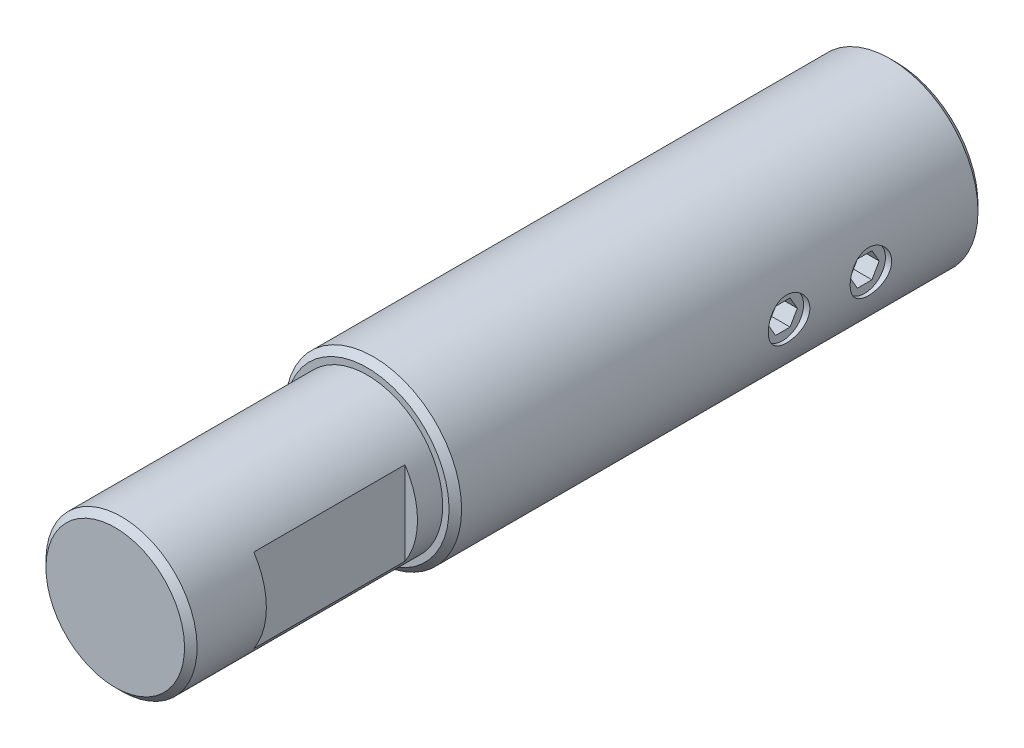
ISO-10303-21;
HEADER;
FILE_DESCRIPTION(('STEP AP214'),'2;1');
FILE_NAME('part.step','',(''),(''),'','','');
FILE_SCHEMA(('AUTOMOTIVE_DESIGN { 1 0 10303 214 1 1 1 1 }'));
ENDSEC;
DATA;
#1=APPLICATION_CONTEXT('core data for automotive mechanical design processes');
#2=APPLICATION_PROTOCOL_DEFINITION('international standard','automotive_design',2000,#1);
#3=PRODUCT_CONTEXT('',#1,'mechanical');
#4=PRODUCT('Part','Part','',(#3));
#5=PRODUCT_RELATED_PRODUCT_CATEGORY('part','',(#4));
#6=PRODUCT_DEFINITION_FORMATION('','',#4);
#7=PRODUCT_DEFINITION_CONTEXT('part definition',#1,'design');
#8=PRODUCT_DEFINITION('design','',#6,#7);
#9=PRODUCT_DEFINITION_SHAPE('','',#8);
#10=(LENGTH_UNIT() NAMED_UNIT(*) SI_UNIT(.MILLI.,.METRE.));
#11=(NAMED_UNIT(*) PLANE_ANGLE_UNIT() SI_UNIT($,.RADIAN.));
#12=(NAMED_UNIT(*) SI_UNIT($,.STERADIAN.) SOLID_ANGLE_UNIT());
#13=UNCERTAINTY_MEASURE_WITH_UNIT(LENGTH_MEASURE(1.E-05),#10,'distance_accuracy_value','');
#14=(GEOMETRIC_REPRESENTATION_CONTEXT(3) GLOBAL_UNCERTAINTY_ASSIGNED_CONTEXT((#13)) GLOBAL_UNIT_ASSIGNED_CONTEXT((#10,
#11,#12)) REPRESENTATION_CONTEXT('',''));
#15=CARTESIAN_POINT('',(0.,0.,0.));
#16=DIRECTION('',(0.,0.,1.));
#17=DIRECTION('',(1.,0.,0.));
#18=AXIS2_PLACEMENT_3D('',#15,#16,#17);
#19=CARTESIAN_POINT('',(0.,0.,0.));
#20=DIRECTION('',(0.,0.,-1.));
#21=DIRECTION('',(0.,-1.,0.));
#22=AXIS2_PLACEMENT_3D('',#19,#20,#21);
#23=CYLINDRICAL_SURFACE('',#22,6.);
#24=CARTESIAN_POINT('',(0.,0.,61.5));
#25=DIRECTION('',(0.,0.,-1.));
#26=DIRECTION('',(0.,-1.,0.));
#27=AXIS2_PLACEMENT_3D('',#24,#25,#26);
#28=CIRCLE('',#27,6.);
#29=CARTESIAN_POINT('',(0.,-6.,61.5));
#30=VERTEX_POINT('',#29);
#31=EDGE_CURVE('E435',#30,#30,#28,.T.);
#32=ORIENTED_EDGE('',*,*,#31,.T.);
#33=EDGE_LOOP('',(#32));
#34=FACE_BOUND('',#33,.T.);
#35=CARTESIAN_POINT('',(0.,0.,42.));
#36=DIRECTION('',(0.,0.,-1.));
#37=DIRECTION('',(0.,-1.,0.));
#38=AXIS2_PLACEMENT_3D('',#35,#36,#37);
#39=CIRCLE('',#38,6.);
#40=CARTESIAN_POINT('',(0.,-6.,42.));
#41=VERTEX_POINT('',#40);
#42=EDGE_CURVE('E456',#41,#41,#39,.T.);
#43=ORIENTED_EDGE('',*,*,#42,.F.);
#44=EDGE_LOOP('',(#43));
#45=FACE_BOUND('',#44,.T.);
#46=CARTESIAN_POINT('',(0.,0.,44.));
#47=DIRECTION('',(0.,0.,1.));
#48=DIRECTION('',(0.,1.,0.));
#49=AXIS2_PLACEMENT_3D('',#46,#47,#48);
#50=CIRCLE('',#49,6.);
#51=CARTESIAN_POINT('',(5.,-3.3166247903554,44.));
#52=VERTEX_POINT('',#51);
#53=CARTESIAN_POINT('',(5.,3.3166247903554,44.));
#54=VERTEX_POINT('',#53);
#55=EDGE_CURVE('E104',#52,#54,#50,.T.);
#56=ORIENTED_EDGE('',*,*,#55,.F.);
#57=DIRECTION('',(0.,0.,1.));
#58=VECTOR('',#57,1.);
#59=CARTESIAN_POINT('',(5.,-3.3166247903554,44.));
#60=LINE('',#59,#58);
#61=CARTESIAN_POINT('',(5.,-3.3166247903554,56.));
#62=VERTEX_POINT('',#61);
#63=EDGE_CURVE('E101',#52,#62,#60,.T.);
#64=ORIENTED_EDGE('',*,*,#63,.T.);
#65=CARTESIAN_POINT('',(0.,0.,56.));
#66=DIRECTION('',(0.,0.,1.));
#67=DIRECTION('',(0.,1.,0.));
#68=AXIS2_PLACEMENT_3D('',#65,#66,#67);
#69=CIRCLE('',#68,6.);
#70=CARTESIAN_POINT('',(5.,3.3166247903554,56.));
#71=VERTEX_POINT('',#70);
#72=EDGE_CURVE('E89',#62,#71,#69,.T.);
#73=ORIENTED_EDGE('',*,*,#72,.T.);
#74=DIRECTION('',(0.,0.,1.));
#75=VECTOR('',#74,1.);
#76=CARTESIAN_POINT('',(5.,3.3166247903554,44.));
#77=LINE('',#76,#75);
#78=EDGE_CURVE('E103',#54,#71,#77,.T.);
#79=ORIENTED_EDGE('',*,*,#78,.F.);
#80=EDGE_LOOP('',(#56,#64,#73,#79));
#81=FACE_BOUND('',#80,.T.);
#82=ADVANCED_FACE('F14',(#34,#45,#81),#23,.T.);
#83=CARTESIAN_POINT('',(0.,0.,0.));
#84=DIRECTION('',(0.,0.,-1.));
#85=DIRECTION('',(0.,-1.,0.));
#86=AXIS2_PLACEMENT_3D('',#83,#84,#85);
#87=CYLINDRICAL_SURFACE('',#86,7.);
#88=CARTESIAN_POINT('',(0.,0.,0.499999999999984));
#89=DIRECTION('',(0.,0.,1.));
#90=DIRECTION('',(0.,1.,0.));
#91=AXIS2_PLACEMENT_3D('',#88,#89,#90);
#92=CIRCLE('',#91,7.);
#93=CARTESIAN_POINT('',(0.,7.,0.499999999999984));
#94=VERTEX_POINT('',#93);
#95=EDGE_CURVE('E439',#94,#94,#92,.T.);
#96=ORIENTED_EDGE('',*,*,#95,.T.);
#97=EDGE_LOOP('',(#96));
#98=FACE_BOUND('',#97,.T.);
#99=CARTESIAN_POINT('',(0.,0.,41.5));
#100=DIRECTION('',(0.,0.,-1.));
#101=DIRECTION('',(0.,-1.,0.));
#102=AXIS2_PLACEMENT_3D('',#99,#100,#101);
#103=CIRCLE('',#102,7.);
#104=CARTESIAN_POINT('',(0.,-7.,41.5));
#105=VERTEX_POINT('',#104);
#106=EDGE_CURVE('E444',#105,#105,#103,.T.);
#107=ORIENTED_EDGE('',*,*,#106,.T.);
#108=EDGE_LOOP('',(#107));
#109=FACE_BOUND('',#108,.T.);
#110=CARTESIAN_POINT('',(6.80275679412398,1.65,9.));
#111=CARTESIAN_POINT('',(6.80275861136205,1.64999713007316,8.90871099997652));
#112=CARTESIAN_POINT('',(6.80461440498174,1.64239813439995,8.8173890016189));
#113=CARTESIAN_POINT('',(6.81182064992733,1.61224414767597,8.63735543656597));
#114=CARTESIAN_POINT('',(6.81717336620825,1.58967946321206,8.54864560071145));
#115=CARTESIAN_POINT('',(6.83073431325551,1.53035515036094,8.37646648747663));
#116=CARTESIAN_POINT('',(6.83893911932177,1.49361254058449,8.2929910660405));
#117=CARTESIAN_POINT('',(6.85727558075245,1.40702581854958,8.13338346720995));
#118=CARTESIAN_POINT('',(6.86740726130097,1.3571815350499,8.05725138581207));
#119=CARTESIAN_POINT('',(6.88867782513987,1.24476461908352,7.91300017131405));
#120=CARTESIAN_POINT('',(6.89983131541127,1.18198309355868,7.84504595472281));
#121=CARTESIAN_POINT('',(6.92176152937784,1.04592427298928,7.72052828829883));
#122=CARTESIAN_POINT('',(6.93253822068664,0.972646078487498,7.66396581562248));
#123=CARTESIAN_POINT('',(6.95266103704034,0.816555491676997,7.56317303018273));
#124=CARTESIAN_POINT('',(6.96198791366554,0.733636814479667,7.51910313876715));
#125=CARTESIAN_POINT('',(6.97799434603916,0.561312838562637,7.44558709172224));
#126=CARTESIAN_POINT('',(6.98467424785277,0.471908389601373,7.41613902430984));
#127=CARTESIAN_POINT('',(6.99453084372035,0.290868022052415,7.37322629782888));
#128=CARTESIAN_POINT('',(6.99776875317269,0.199301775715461,7.35948200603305));
#129=CARTESIAN_POINT('',(7.00058928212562,0.0151097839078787,7.34749086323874));
#130=CARTESIAN_POINT('',(7.00017238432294,-0.0775158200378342,7.34924196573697));
#131=CARTESIAN_POINT('',(6.99577641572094,-0.259263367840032,7.36798740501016));
#132=CARTESIAN_POINT('',(6.99186783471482,-0.348418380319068,7.38468011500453));
#133=CARTESIAN_POINT('',(6.98100889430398,-0.52262462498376,7.43235207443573));
#134=CARTESIAN_POINT('',(6.97405838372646,-0.607675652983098,7.46333203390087));
#135=CARTESIAN_POINT('',(6.95778608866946,-0.77207438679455,7.53895377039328));
#136=CARTESIAN_POINT('',(6.94844521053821,-0.851369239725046,7.58370617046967));
#137=CARTESIAN_POINT('',(6.92841069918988,-1.00143136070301,7.68551922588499));
#138=CARTESIAN_POINT('',(6.91771685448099,-1.07219729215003,7.74258180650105));
#139=CARTESIAN_POINT('',(6.89584251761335,-1.20498965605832,7.86902452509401));
#140=CARTESIAN_POINT('',(6.884656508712,-1.26676421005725,7.93866849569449));
#141=CARTESIAN_POINT('',(6.8632971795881,-1.37780936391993,8.0874443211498));
#142=CARTESIAN_POINT('',(6.85312389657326,-1.42707950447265,8.16657652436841));
#143=CARTESIAN_POINT('',(6.83492437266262,-1.51185477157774,8.33253525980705));
#144=CARTESIAN_POINT('',(6.82690665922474,-1.54730546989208,8.41939059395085));
#145=CARTESIAN_POINT('',(6.8140390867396,-1.6030277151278,8.59806127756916));
#146=CARTESIAN_POINT('',(6.80918863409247,-1.62330210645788,8.68987569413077));
#147=CARTESIAN_POINT('',(6.80332774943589,-1.64769127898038,8.87353855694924));
#148=CARTESIAN_POINT('',(6.80222947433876,-1.65217579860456,8.96533515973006));
#149=CARTESIAN_POINT('',(6.80375919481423,-1.64586488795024,9.14836457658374));
#150=CARTESIAN_POINT('',(6.80638688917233,-1.63507069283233,9.23959743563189));
#151=CARTESIAN_POINT('',(6.81498886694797,-1.59883140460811,9.41757745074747));
#152=CARTESIAN_POINT('',(6.82091521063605,-1.57359604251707,9.50436984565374));
#153=CARTESIAN_POINT('',(6.83540229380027,-1.50942069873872,9.67249368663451));
#154=CARTESIAN_POINT('',(6.84396331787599,-1.47047923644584,9.75382454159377));
#155=CARTESIAN_POINT('',(6.86294389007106,-1.37920410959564,9.91029905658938));
#156=CARTESIAN_POINT('',(6.87339357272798,-1.32664621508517,9.98530818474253));
#157=CARTESIAN_POINT('',(6.89489755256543,-1.20991829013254,10.1255780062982));
#158=CARTESIAN_POINT('',(6.90595193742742,-1.14574657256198,10.1908372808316));
#159=CARTESIAN_POINT('',(6.92771364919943,-1.00592681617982,10.3112229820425));
#160=CARTESIAN_POINT('',(6.93840801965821,-0.930057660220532,10.3660953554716));
#161=CARTESIAN_POINT('',(6.95799159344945,-0.769965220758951,10.4623180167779));
#162=CARTESIAN_POINT('',(6.96688088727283,-0.685742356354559,10.503668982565));
#163=CARTESIAN_POINT('',(6.9817988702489,-0.511894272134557,10.5713378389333));
#164=CARTESIAN_POINT('',(6.98784709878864,-0.422310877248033,10.5977586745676));
#165=CARTESIAN_POINT('',(6.99648655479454,-0.239816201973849,10.6351328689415));
#166=CARTESIAN_POINT('',(6.99907837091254,-0.146905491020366,10.6460888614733));
#167=CARTESIAN_POINT('',(7.00049202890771,0.0372082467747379,10.6520881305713));
#168=CARTESIAN_POINT('',(6.9994031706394,0.128398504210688,10.647508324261));
#169=CARTESIAN_POINT('',(6.99377268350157,0.308670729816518,10.6234197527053));
#170=CARTESIAN_POINT('',(6.98923113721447,0.397752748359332,10.6039113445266));
#171=CARTESIAN_POINT('',(6.97721604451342,0.570933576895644,10.5507117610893));
#172=CARTESIAN_POINT('',(6.96975517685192,0.655052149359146,10.5170818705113));
#173=CARTESIAN_POINT('',(6.95269208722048,0.81649879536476,10.4366509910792));
#174=CARTESIAN_POINT('',(6.94308962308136,0.893826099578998,10.3898485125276));
#175=CARTESIAN_POINT('',(6.92252474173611,1.04130725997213,10.2832139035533));
#176=CARTESIAN_POINT('',(6.91153737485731,1.11126948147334,10.2231215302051));
#177=CARTESIAN_POINT('',(6.88956325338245,1.24024523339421,10.0921276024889));
#178=CARTESIAN_POINT('',(6.8785764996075,1.29925605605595,10.0212233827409));
#179=CARTESIAN_POINT('',(6.85764827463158,1.40557849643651,9.86924540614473));
#180=CARTESIAN_POINT('',(6.84772646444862,1.45268661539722,9.7880263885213));
#181=CARTESIAN_POINT('',(6.83030721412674,1.53250931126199,9.61860266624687));
#182=CARTESIAN_POINT('',(6.82280787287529,1.56523518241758,9.53040350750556));
#183=CARTESIAN_POINT('',(6.81235745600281,1.61002842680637,9.36853084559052));
#184=CARTESIAN_POINT('',(6.80878274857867,1.62498700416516,9.29568399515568));
#185=CARTESIAN_POINT('',(6.8039817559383,1.64497362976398,9.14856531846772));
#186=CARTESIAN_POINT('',(6.80275531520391,1.65000233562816,9.07429358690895));
#187=CARTESIAN_POINT('',(6.80275679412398,1.65,9.));
#188=B_SPLINE_CURVE_WITH_KNOTS('',3,(#110,#111,#112,#113,#114,#115,#116,#117,#118,#119,#120,
#121,#122,#123,#124,#125,#126,#127,#128,#129,#130,#131,#132,#133,#134,#135,#136,#137,#138,#139,
#140,#141,#142,#143,#144,#145,#146,#147,#148,#149,#150,#151,#152,#153,#154,#155,#156,#157,#158,
#159,#160,#161,#162,#163,#164,#165,#166,#167,#168,#169,#170,#171,#172,#173,#174,#175,#176,#177,
#178,#179,#180,#181,#182,#183,#184,#185,#186,#187),.UNSPECIFIED.,.T.,.F.,(4,2,2,2,2,2,2,2,2,2,2,
2,2,2,2,2,2,2,2,2,2,2,2,2,2,2,2,2,2,2,2,2,2,2,2,2,2,2,4),(0.,0.273594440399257,
0.547366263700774,0.820810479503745,1.0942582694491,1.37252656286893,1.65081871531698,
1.9325374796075,2.21421939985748,2.49080324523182,2.76735056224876,3.03843805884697,
3.30953902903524,3.58287702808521,3.85625780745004,4.13623055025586,4.41621357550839,
4.69728844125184,4.97831061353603,5.25270687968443,5.52708096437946,5.79756789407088,
6.06808405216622,6.34337456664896,6.61870510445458,6.90008328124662,7.18144734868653,
7.46084693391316,7.74019892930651,8.01282246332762,8.28543947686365,8.55688541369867,
8.82836206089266,9.10571835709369,9.38314313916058,9.66503130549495,9.9466977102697,
10.1693714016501,10.3920303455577),.UNSPECIFIED.);
#189=CARTESIAN_POINT('',(6.80275679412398,1.65,9.));
#190=VERTEX_POINT('',#189);
#191=EDGE_CURVE('E107',#190,#190,#188,.T.);
#192=ORIENTED_EDGE('',*,*,#191,.T.);
#193=EDGE_LOOP('',(#192));
#194=FACE_BOUND('',#193,.T.);
#195=CARTESIAN_POINT('',(6.80275679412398,1.65,15.5));
#196=CARTESIAN_POINT('',(6.80275861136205,1.64999713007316,15.4087109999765));
#197=CARTESIAN_POINT('',(6.80461440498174,1.64239813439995,15.3173890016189));
#198=CARTESIAN_POINT('',(6.81182064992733,1.61224414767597,15.137355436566));
#199=CARTESIAN_POINT('',(6.81717336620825,1.58967946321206,15.0486456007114));
#200=CARTESIAN_POINT('',(6.83073431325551,1.53035515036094,14.8764664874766));
#201=CARTESIAN_POINT('',(6.83893911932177,1.49361254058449,14.7929910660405));
#202=CARTESIAN_POINT('',(6.85727558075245,1.40702581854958,14.63338346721));
#203=CARTESIAN_POINT('',(6.86740726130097,1.3571815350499,14.5572513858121));
#204=CARTESIAN_POINT('',(6.88867782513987,1.24476461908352,14.4130001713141));
#205=CARTESIAN_POINT('',(6.89983131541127,1.18198309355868,14.3450459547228));
#206=CARTESIAN_POINT('',(6.92176152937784,1.04592427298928,14.2205282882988));
#207=CARTESIAN_POINT('',(6.93253822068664,0.972646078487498,14.1639658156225));
#208=CARTESIAN_POINT('',(6.95266103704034,0.816555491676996,14.0631730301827));
#209=CARTESIAN_POINT('',(6.96198791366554,0.733636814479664,14.0191031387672));
#210=CARTESIAN_POINT('',(6.97799434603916,0.561312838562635,13.9455870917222));
#211=CARTESIAN_POINT('',(6.98467424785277,0.471908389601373,13.9161390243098));
#212=CARTESIAN_POINT('',(6.99453084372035,0.290868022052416,13.8732262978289));
#213=CARTESIAN_POINT('',(6.99776875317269,0.199301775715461,13.859482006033));
#214=CARTESIAN_POINT('',(7.00058928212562,0.0151097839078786,13.8474908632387));
#215=CARTESIAN_POINT('',(7.00017238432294,-0.077515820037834,13.849241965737));
#216=CARTESIAN_POINT('',(6.99577641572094,-0.259263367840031,13.8679874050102));
#217=CARTESIAN_POINT('',(6.99186783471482,-0.348418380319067,13.8846801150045));
#218=CARTESIAN_POINT('',(6.98100889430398,-0.522624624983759,13.9323520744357));
#219=CARTESIAN_POINT('',(6.97405838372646,-0.607675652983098,13.9633320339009));
#220=CARTESIAN_POINT('',(6.95778608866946,-0.772074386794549,14.0389537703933));
#221=CARTESIAN_POINT('',(6.94844521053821,-0.851369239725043,14.0837061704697));
#222=CARTESIAN_POINT('',(6.92841069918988,-1.001431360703,14.185519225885));
#223=CARTESIAN_POINT('',(6.91771685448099,-1.07219729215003,14.242581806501));
#224=CARTESIAN_POINT('',(6.89584251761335,-1.20498965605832,14.369024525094));
#225=CARTESIAN_POINT('',(6.88465650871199,-1.26676421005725,14.4386684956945));
#226=CARTESIAN_POINT('',(6.8632971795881,-1.37780936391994,14.5874443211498));
#227=CARTESIAN_POINT('',(6.85312389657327,-1.42707950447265,14.6665765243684));
#228=CARTESIAN_POINT('',(6.83492437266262,-1.51185477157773,14.8325352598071));
#229=CARTESIAN_POINT('',(6.82690665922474,-1.54730546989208,14.9193905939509));
#230=CARTESIAN_POINT('',(6.8140390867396,-1.6030277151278,15.0980612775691));
#231=CARTESIAN_POINT('',(6.80918863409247,-1.62330210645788,15.1898756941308));
#232=CARTESIAN_POINT('',(6.80332774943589,-1.64769127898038,15.3735385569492));
#233=CARTESIAN_POINT('',(6.80222947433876,-1.65217579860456,15.4653351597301));
#234=CARTESIAN_POINT('',(6.80375919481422,-1.64586488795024,15.6483645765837));
#235=CARTESIAN_POINT('',(6.80638688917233,-1.63507069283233,15.7395974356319));
#236=CARTESIAN_POINT('',(6.81498886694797,-1.59883140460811,15.9175774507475));
#237=CARTESIAN_POINT('',(6.82091521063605,-1.57359604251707,16.0043698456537));
#238=CARTESIAN_POINT('',(6.83540229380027,-1.50942069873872,16.1724936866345));
#239=CARTESIAN_POINT('',(6.843963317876,-1.47047923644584,16.2538245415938));
#240=CARTESIAN_POINT('',(6.86294389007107,-1.37920410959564,16.4102990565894));
#241=CARTESIAN_POINT('',(6.87339357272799,-1.32664621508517,16.4853081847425));
#242=CARTESIAN_POINT('',(6.89489755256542,-1.20991829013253,16.6255780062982));
#243=CARTESIAN_POINT('',(6.90595193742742,-1.14574657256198,16.6908372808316));
#244=CARTESIAN_POINT('',(6.92771364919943,-1.00592681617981,16.8112229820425));
#245=CARTESIAN_POINT('',(6.93840801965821,-0.930057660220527,16.8660953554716));
#246=CARTESIAN_POINT('',(6.95799159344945,-0.769965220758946,16.9623180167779));
#247=CARTESIAN_POINT('',(6.96688088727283,-0.685742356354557,17.003668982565));
#248=CARTESIAN_POINT('',(6.9817988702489,-0.511894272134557,17.0713378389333));
#249=CARTESIAN_POINT('',(6.98784709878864,-0.422310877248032,17.0977586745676));
#250=CARTESIAN_POINT('',(6.99648655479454,-0.239816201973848,17.1351328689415));
#251=CARTESIAN_POINT('',(6.99907837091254,-0.146905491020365,17.1460888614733));
#252=CARTESIAN_POINT('',(7.00049202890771,0.0372082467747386,17.1520881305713));
#253=CARTESIAN_POINT('',(6.9994031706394,0.12839850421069,17.147508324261));
#254=CARTESIAN_POINT('',(6.99377268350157,0.30867072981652,17.1234197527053));
#255=CARTESIAN_POINT('',(6.98923113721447,0.397752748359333,17.1039113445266));
#256=CARTESIAN_POINT('',(6.97721604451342,0.570933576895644,17.0507117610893));
#257=CARTESIAN_POINT('',(6.96975517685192,0.655052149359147,17.0170818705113));
#258=CARTESIAN_POINT('',(6.95269208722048,0.816498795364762,16.9366509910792));
#259=CARTESIAN_POINT('',(6.94308962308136,0.893826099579,16.8898485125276));
#260=CARTESIAN_POINT('',(6.92252474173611,1.04130725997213,16.7832139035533));
#261=CARTESIAN_POINT('',(6.91153737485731,1.11126948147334,16.7231215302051));
#262=CARTESIAN_POINT('',(6.88956325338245,1.24024523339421,16.5921276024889));
#263=CARTESIAN_POINT('',(6.87857649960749,1.29925605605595,16.5212233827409));
#264=CARTESIAN_POINT('',(6.85764827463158,1.40557849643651,16.3692454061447));
#265=CARTESIAN_POINT('',(6.84772646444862,1.45268661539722,16.2880263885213));
#266=CARTESIAN_POINT('',(6.83030721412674,1.53250931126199,16.1186026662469));
#267=CARTESIAN_POINT('',(6.82280787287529,1.56523518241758,16.0304035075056));
#268=CARTESIAN_POINT('',(6.81235745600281,1.61002842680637,15.8685308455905));
#269=CARTESIAN_POINT('',(6.80878274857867,1.62498700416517,15.7956839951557));
#270=CARTESIAN_POINT('',(6.8039817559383,1.64497362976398,15.6485653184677));
#271=CARTESIAN_POINT('',(6.80275531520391,1.65000233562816,15.574293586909));
#272=CARTESIAN_POINT('',(6.80275679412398,1.65,15.5));
#273=B_SPLINE_CURVE_WITH_KNOTS('',3,(#195,#196,#197,#198,#199,#200,#201,#202,#203,#204,#205,
#206,#207,#208,#209,#210,#211,#212,#213,#214,#215,#216,#217,#218,#219,#220,#221,#222,#223,#224,
#225,#226,#227,#228,#229,#230,#231,#232,#233,#234,#235,#236,#237,#238,#239,#240,#241,#242,#243,
#244,#245,#246,#247,#248,#249,#250,#251,#252,#253,#254,#255,#256,#257,#258,#259,#260,#261,#262,
#263,#264,#265,#266,#267,#268,#269,#270,#271,#272),.UNSPECIFIED.,.T.,.F.,(4,2,2,2,2,2,2,2,2,2,2,
2,2,2,2,2,2,2,2,2,2,2,2,2,2,2,2,2,2,2,2,2,2,2,2,2,2,2,4),(0.,0.273594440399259,
0.547366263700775,0.820810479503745,1.0942582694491,1.37252656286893,1.65081871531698,
1.9325374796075,2.21421939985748,2.49080324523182,2.76735056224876,3.03843805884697,
3.30953902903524,3.5828770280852,3.85625780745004,4.13623055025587,4.4162135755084,
4.69728844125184,4.97831061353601,5.25270687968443,5.52708096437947,5.79756789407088,
6.06808405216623,6.34337456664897,6.61870510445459,6.90008328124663,7.18144734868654,
7.46084693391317,7.74019892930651,8.01282246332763,8.28543947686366,8.55688541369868,
8.82836206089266,9.10571835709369,9.38314313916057,9.66503130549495,9.94669771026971,
10.1693714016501,10.3920303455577),.UNSPECIFIED.);
#274=CARTESIAN_POINT('',(6.80275679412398,1.65,15.5));
#275=VERTEX_POINT('',#274);
#276=EDGE_CURVE('E110',#275,#275,#273,.T.);
#277=ORIENTED_EDGE('',*,*,#276,.T.);
#278=EDGE_LOOP('',(#277));
#279=FACE_BOUND('',#278,.T.);
#280=ADVANCED_FACE('F125',(#98,#109,#194,#279),#87,.T.);
#281=CARTESIAN_POINT('',(-6.,0.,62.));
#282=DIRECTION('',(0.,0.,-1.));
#283=DIRECTION('',(0.,-1.,0.));
#284=AXIS2_PLACEMENT_3D('',#281,#282,#283);
#285=PLANE('',#284);
#286=CARTESIAN_POINT('',(0.,0.,62.));
#287=DIRECTION('',(0.,0.,-1.));
#288=DIRECTION('',(0.,-1.,0.));
#289=AXIS2_PLACEMENT_3D('',#286,#287,#288);
#290=CIRCLE('',#289,5.5);
#291=CARTESIAN_POINT('',(0.,-5.5,62.));
#292=VERTEX_POINT('',#291);
#293=EDGE_CURVE('E431',#292,#292,#290,.F.);
#294=ORIENTED_EDGE('',*,*,#293,.T.);
#295=EDGE_LOOP('',(#294));
#296=FACE_BOUND('',#295,.T.);
#297=ADVANCED_FACE('F467',(#296),#285,.F.);
#298=CARTESIAN_POINT('',(-7.,0.,42.));
#299=DIRECTION('',(0.,0.,-1.));
#300=DIRECTION('',(0.,-1.,0.));
#301=AXIS2_PLACEMENT_3D('',#298,#299,#300);
#302=PLANE('',#301);
#303=CARTESIAN_POINT('',(0.,0.,42.));
#304=DIRECTION('',(0.,0.,-1.));
#305=DIRECTION('',(0.,-1.,0.));
#306=AXIS2_PLACEMENT_3D('',#303,#304,#305);
#307=CIRCLE('',#306,6.5);
#308=CARTESIAN_POINT('',(0.,-6.5,42.));
#309=VERTEX_POINT('',#308);
#310=EDGE_CURVE('E18',#309,#309,#307,.F.);
#311=ORIENTED_EDGE('',*,*,#310,.T.);
#312=EDGE_LOOP('',(#311));
#313=FACE_BOUND('',#312,.T.);
#314=ORIENTED_EDGE('',*,*,#42,.T.);
#315=EDGE_LOOP('',(#314));
#316=FACE_BOUND('',#315,.T.);
#317=ADVANCED_FACE('F473',(#313,#316),#302,.F.);
#318=CARTESIAN_POINT('',(-4.,0.,0.));
#319=DIRECTION('',(0.,0.,1.));
#320=DIRECTION('',(0.,1.,0.));
#321=AXIS2_PLACEMENT_3D('',#318,#319,#320);
#322=PLANE('',#321);
#323=CARTESIAN_POINT('',(0.,0.,0.));
#324=DIRECTION('',(0.,0.,1.));
#325=DIRECTION('',(0.,1.,0.));
#326=AXIS2_PLACEMENT_3D('',#323,#324,#325);
#327=CIRCLE('',#326,6.5);
#328=CARTESIAN_POINT('',(0.,6.5,0.));
#329=VERTEX_POINT('',#328);
#330=EDGE_CURVE('E447',#329,#329,#327,.F.);
#331=ORIENTED_EDGE('',*,*,#330,.T.);
#332=EDGE_LOOP('',(#331));
#333=FACE_BOUND('',#332,.T.);
#334=CARTESIAN_POINT('',(0.,0.,0.));
#335=DIRECTION('',(0.,0.,1.));
#336=DIRECTION('',(0.,1.,0.));
#337=AXIS2_PLACEMENT_3D('',#334,#335,#336);
#338=CIRCLE('',#337,4.57735026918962);
#339=CARTESIAN_POINT('',(0.,4.57735026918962,0.));
#340=VERTEX_POINT('',#339);
#341=EDGE_CURVE('E450',#340,#340,#338,.T.);
#342=ORIENTED_EDGE('',*,*,#341,.T.);
#343=EDGE_LOOP('',(#342));
#344=FACE_BOUND('',#343,.T.);
#345=ADVANCED_FACE('F143',(#333,#344),#322,.F.);
#346=CARTESIAN_POINT('',(0.,0.,0.));
#347=DIRECTION('',(0.,0.,-1.));
#348=DIRECTION('',(0.,-1.,0.));
#349=AXIS2_PLACEMENT_3D('',#346,#347,#348);
#350=CYLINDRICAL_SURFACE('',#349,4.);
#351=CARTESIAN_POINT('',(4.,0.,7.));
#352=CARTESIAN_POINT('',(3.99999426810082,-0.105143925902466,7.00000660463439));
#353=CARTESIAN_POINT('',(3.99580982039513,-0.210413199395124,7.00834014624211));
#354=CARTESIAN_POINT('',(3.97948312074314,-0.417840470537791,7.04130576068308));
#355=CARTESIAN_POINT('',(3.96732575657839,-0.519992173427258,7.06596878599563));
#356=CARTESIAN_POINT('',(3.93632558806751,-0.717867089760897,7.13038761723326));
#357=CARTESIAN_POINT('',(3.91750878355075,-0.813613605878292,7.17008476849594));
#358=CARTESIAN_POINT('',(3.87491553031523,-0.996945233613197,7.26314124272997));
#359=CARTESIAN_POINT('',(3.85113947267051,-1.08453098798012,7.31649948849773));
#360=CARTESIAN_POINT('',(3.79912516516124,-1.25501563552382,7.43903449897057));
#361=CARTESIAN_POINT('',(3.77070398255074,-1.33731042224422,7.50897295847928));
#362=CARTESIAN_POINT('',(3.71319940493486,-1.48955888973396,7.66104295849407));
#363=CARTESIAN_POINT('',(3.68411552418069,-1.55950316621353,7.74318370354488));
#364=CARTESIAN_POINT('',(3.62597902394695,-1.69050400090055,7.92496669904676));
#365=CARTESIAN_POINT('',(3.59710373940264,-1.75045067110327,8.02547219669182));
#366=CARTESIAN_POINT('',(3.54571957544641,-1.85233645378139,8.23673467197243));
#367=CARTESIAN_POINT('',(3.52320615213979,-1.89428842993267,8.34748425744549));
#368=CARTESIAN_POINT('',(3.48915734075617,-1.95626488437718,8.56933021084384));
#369=CARTESIAN_POINT('',(3.47704543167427,-1.97745171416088,8.68000890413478));
#370=CARTESIAN_POINT('',(3.46363779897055,-2.00085398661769,8.90395767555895));
#371=CARTESIAN_POINT('',(3.46233138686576,-2.00308817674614,9.01722508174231));
#372=CARTESIAN_POINT('',(3.47021860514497,-1.98937457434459,9.22857204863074));
#373=CARTESIAN_POINT('',(3.47817527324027,-1.97556911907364,9.3268480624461));
#374=CARTESIAN_POINT('',(3.50152457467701,-1.93387969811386,9.51944381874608));
#375=CARTESIAN_POINT('',(3.51691957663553,-1.9059912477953,9.61376229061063));
#376=CARTESIAN_POINT('',(3.55374952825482,-1.83641956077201,9.79845826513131));
#377=CARTESIAN_POINT('',(3.57531681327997,-1.79443013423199,9.88869279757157));
#378=CARTESIAN_POINT('',(3.62206808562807,-1.69808337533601,10.06126858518));
#379=CARTESIAN_POINT('',(3.64725369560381,-1.64372048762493,10.1436062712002));
#380=CARTESIAN_POINT('',(3.70226315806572,-1.51613210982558,10.3090425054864));
#381=CARTESIAN_POINT('',(3.73227020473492,-1.44138891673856,10.3909137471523));
#382=CARTESIAN_POINT('',(3.79095246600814,-1.27911115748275,10.5414708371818));
#383=CARTESIAN_POINT('',(3.81962703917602,-1.19157051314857,10.6101503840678));
#384=CARTESIAN_POINT('',(3.87403974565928,-1.0010330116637,10.7353713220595));
#385=CARTESIAN_POINT('',(3.89957968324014,-0.897507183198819,10.7912009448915));
#386=CARTESIAN_POINT('',(3.94315762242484,-0.680932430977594,10.884194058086));
#387=CARTESIAN_POINT('',(3.96120157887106,-0.567891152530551,10.9213723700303));
#388=CARTESIAN_POINT('',(3.98648667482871,-0.345532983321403,10.9729508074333));
#389=CARTESIAN_POINT('',(3.9944987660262,-0.236683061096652,10.9889824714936));
#390=CARTESIAN_POINT('',(4.00146026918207,-0.0175591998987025,11.002929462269));
#391=CARTESIAN_POINT('',(4.00041397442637,0.0927140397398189,11.0008533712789));
#392=CARTESIAN_POINT('',(3.9898238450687,0.302465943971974,10.9795866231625));
#393=CARTESIAN_POINT('',(3.98094491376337,0.402118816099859,10.96173493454));
#394=CARTESIAN_POINT('',(3.9564434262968,0.596813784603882,10.9115238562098));
#395=CARTESIAN_POINT('',(3.94082012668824,0.691855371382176,10.879162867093));
#396=CARTESIAN_POINT('',(3.90368502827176,0.877777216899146,10.8000030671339));
#397=CARTESIAN_POINT('',(3.88201763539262,0.968460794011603,10.7528178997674));
#398=CARTESIAN_POINT('',(3.83487948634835,1.14092272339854,10.6457849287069));
#399=CARTESIAN_POINT('',(3.80940711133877,1.22269725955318,10.5859317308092));
#400=CARTESIAN_POINT('',(3.75416442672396,1.38353537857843,10.4484791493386));
#401=CARTESIAN_POINT('',(3.72421769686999,1.46154415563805,10.3697142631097));
#402=CARTESIAN_POINT('',(3.6652478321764,1.60371264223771,10.2001496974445));
#403=CARTESIAN_POINT('',(3.63622534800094,1.66786277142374,10.1093417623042));
#404=CARTESIAN_POINT('',(3.58102384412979,1.78341582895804,9.91271269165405));
#405=CARTESIAN_POINT('',(3.55505059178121,1.8340509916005,9.80637746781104));
#406=CARTESIAN_POINT('',(3.51148144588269,1.91616565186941,9.58497986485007));
#407=CARTESIAN_POINT('',(3.493874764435,1.94766983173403,9.46992894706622));
#408=CARTESIAN_POINT('',(3.47123002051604,1.98772337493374,9.24617955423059));
#409=CARTESIAN_POINT('',(3.4651476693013,1.9981859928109,9.13793149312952));
#410=CARTESIAN_POINT('',(3.46330709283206,2.00137830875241,8.92110586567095));
#411=CARTESIAN_POINT('',(3.4675443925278,1.99411569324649,8.81252846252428));
#412=CARTESIAN_POINT('',(3.48475724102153,1.96385225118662,8.60903299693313));
#413=CARTESIAN_POINT('',(3.49686188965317,1.94241662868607,8.51379905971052));
#414=CARTESIAN_POINT('',(3.52742032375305,1.88635071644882,8.32838376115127));
#415=CARTESIAN_POINT('',(3.54587615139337,1.85171618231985,8.23820403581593));
#416=CARTESIAN_POINT('',(3.58857060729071,1.76763149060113,8.05875029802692));
#417=CARTESIAN_POINT('',(3.61311444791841,1.7173422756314,7.96994419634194));
#418=CARTESIAN_POINT('',(3.66470663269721,1.60430194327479,7.80145092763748));
#419=CARTESIAN_POINT('',(3.69175627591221,1.54154434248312,7.72176853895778));
#420=CARTESIAN_POINT('',(3.74924646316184,1.39640665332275,7.56371603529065));
#421=CARTESIAN_POINT('',(3.77969966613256,1.31256884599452,7.48668179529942));
#422=CARTESIAN_POINT('',(3.83755504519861,1.1323096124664,7.34747403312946));
#423=CARTESIAN_POINT('',(3.8649555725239,1.0358814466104,7.28530852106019));
#424=CARTESIAN_POINT('',(3.91396019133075,0.831863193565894,7.17752727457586));
#425=CARTESIAN_POINT('',(3.93552192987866,0.724199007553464,7.13203166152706));
#426=CARTESIAN_POINT('',(3.97002682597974,0.501484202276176,7.06038366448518));
#427=CARTESIAN_POINT('',(3.98299446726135,0.386455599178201,7.03417630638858));
#428=CARTESIAN_POINT('',(3.99390923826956,0.225203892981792,7.01220517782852));
#429=CARTESIAN_POINT('',(3.99618730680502,0.180323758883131,7.00763471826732));
#430=CARTESIAN_POINT('',(3.99923393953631,0.0903034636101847,7.00153066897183));
#431=CARTESIAN_POINT('',(4.00000246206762,0.0451632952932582,6.99999716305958));
#432=CARTESIAN_POINT('',(4.,0.,7.));
#433=B_SPLINE_CURVE_WITH_KNOTS('',3,(#351,#352,#353,#354,#355,#356,#357,#358,#359,#360,#361,
#362,#363,#364,#365,#366,#367,#368,#369,#370,#371,#372,#373,#374,#375,#376,#377,#378,#379,#380,
#381,#382,#383,#384,#385,#386,#387,#388,#389,#390,#391,#392,#393,#394,#395,#396,#397,#398,#399,
#400,#401,#402,#403,#404,#405,#406,#407,#408,#409,#410,#411,#412,#413,#414,#415,#416,#417,#418,
#419,#420,#421,#422,#423,#424,#425,#426,#427,#428,#429,#430,#431,#432),.UNSPECIFIED.,.T.,.F.,(4,
2,2,2,2,2,2,2,2,2,2,2,2,2,2,2,2,2,2,2,2,2,2,2,2,2,2,2,2,2,2,2,2,2,2,2,2,2,2,2,4),(0.,
0.315248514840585,0.631096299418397,0.945724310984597,1.26032752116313,1.59396351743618,
1.92785247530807,2.28763452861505,2.64715895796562,2.98516024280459,3.32282714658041,
3.62011424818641,3.91749607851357,4.22180480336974,4.52625042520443,4.86929882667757,
5.21251069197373,5.57166044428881,5.93052433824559,6.25966580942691,6.58865129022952,
6.89213813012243,7.19565843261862,7.50785712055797,7.82018901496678,8.16319221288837,
8.50643177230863,8.86629364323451,9.22569023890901,9.55058615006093,9.87534119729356,
10.1691586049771,10.463070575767,10.7767291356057,11.0905512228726,11.4425048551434,
11.7946476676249,12.1492802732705,12.502898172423,12.6383056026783,12.7737167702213),.UNSPECIFIED.);
#434=CARTESIAN_POINT('',(4.,0.,7.));
#435=VERTEX_POINT('',#434);
#436=EDGE_CURVE('E9',#435,#435,#433,.T.);
#437=ORIENTED_EDGE('',*,*,#436,.F.);
#438=EDGE_LOOP('',(#437));
#439=FACE_BOUND('',#438,.T.);
#440=CARTESIAN_POINT('',(3.60555127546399,-1.73205080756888,16.5));
#441=CARTESIAN_POINT('',(3.63330072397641,-1.6742839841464,16.6000507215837));
#442=CARTESIAN_POINT('',(3.66340889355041,-1.60804520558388,16.6947282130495));
#443=CARTESIAN_POINT('',(3.72473015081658,-1.46040741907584,16.8713190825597));
#444=CARTESIAN_POINT('',(3.75594606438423,-1.37896698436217,16.9531964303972));
#445=CARTESIAN_POINT('',(3.81605659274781,-1.20265571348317,17.1021634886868));
#446=CARTESIAN_POINT('',(3.84495025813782,-1.10777942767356,17.1692471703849));
#447=CARTESIAN_POINT('',(3.8972467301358,-0.906764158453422,17.286416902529));
#448=CARTESIAN_POINT('',(3.92065575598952,-0.800638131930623,17.3365222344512));
#449=CARTESIAN_POINT('',(3.9585333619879,-0.584425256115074,17.416026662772));
#450=CARTESIAN_POINT('',(3.97332921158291,-0.474679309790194,17.4461906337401));
#451=CARTESIAN_POINT('',(3.99370450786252,-0.250836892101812,17.4874624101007));
#452=CARTESIAN_POINT('',(3.99928959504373,-0.136743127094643,17.4985818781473));
#453=CARTESIAN_POINT('',(4.00052059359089,0.0805769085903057,17.501038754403));
#454=CARTESIAN_POINT('',(3.99707902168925,0.183782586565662,17.4941923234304));
#455=CARTESIAN_POINT('',(3.98250691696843,0.387363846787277,17.4648216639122));
#456=CARTESIAN_POINT('',(3.97137663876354,0.487739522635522,17.4422979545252));
#457=CARTESIAN_POINT('',(3.94266442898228,0.681856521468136,17.3828878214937));
#458=CARTESIAN_POINT('',(3.92515694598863,0.775660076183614,17.3461668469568));
#459=CARTESIAN_POINT('',(3.88520912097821,0.955865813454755,17.259636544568));
#460=CARTESIAN_POINT('',(3.86276744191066,1.04226598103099,17.2098236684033));
#461=CARTESIAN_POINT('',(3.812752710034,1.21304818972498,17.0937543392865));
#462=CARTESIAN_POINT('',(3.78490681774,1.29664921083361,17.0264671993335));
#463=CARTESIAN_POINT('',(3.728106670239,1.45191920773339,16.8796249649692));
#464=CARTESIAN_POINT('',(3.69915157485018,1.5235789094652,16.8000604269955));
#465=CARTESIAN_POINT('',(3.64057503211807,1.65894331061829,16.6230841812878));
#466=CARTESIAN_POINT('',(3.61109645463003,1.72150029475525,16.5247407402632));
#467=CARTESIAN_POINT('',(3.55783946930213,1.82904300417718,16.3174433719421));
#468=CARTESIAN_POINT('',(3.53405805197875,1.87403801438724,16.2084950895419));
#469=CARTESIAN_POINT('',(3.49672204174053,1.94278435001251,15.9881247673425));
#470=CARTESIAN_POINT('',(3.48273910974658,1.96743518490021,15.8770599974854));
#471=CARTESIAN_POINT('',(3.46560346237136,1.9974778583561,15.651584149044));
#472=CARTESIAN_POINT('',(3.46243843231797,2.00289159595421,15.5371770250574));
#473=CARTESIAN_POINT('',(3.46715158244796,1.99470641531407,15.3235317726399));
#474=CARTESIAN_POINT('',(3.47371297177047,1.98337510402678,15.2241668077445));
#475=CARTESIAN_POINT('',(3.49462495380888,1.946289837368,15.0290176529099));
#476=CARTESIAN_POINT('',(3.50897787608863,1.92053156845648,14.9332345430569));
#477=CARTESIAN_POINT('',(3.54385710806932,1.85538137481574,14.7467342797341));
#478=CARTESIAN_POINT('',(3.56443473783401,1.81587568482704,14.6560669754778));
#479=CARTESIAN_POINT('',(3.60953060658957,1.72449452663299,14.4822728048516));
#480=CARTESIAN_POINT('',(3.63405047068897,1.67261395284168,14.3991490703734));
#481=CARTESIAN_POINT('',(3.68799561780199,1.55038171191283,14.2317903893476));
#482=CARTESIAN_POINT('',(3.71765053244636,1.47852991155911,14.148722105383));
#483=CARTESIAN_POINT('',(3.77614005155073,1.32202408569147,13.9952496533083));
#484=CARTESIAN_POINT('',(3.80497420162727,1.23736312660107,13.9248523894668));
#485=CARTESIAN_POINT('',(3.86059866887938,1.05152767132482,13.7947484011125));
#486=CARTESIAN_POINT('',(3.88717160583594,0.949677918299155,13.7359049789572));
#487=CARTESIAN_POINT('',(3.93323680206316,0.735911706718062,13.6365906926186));
#488=CARTESIAN_POINT('',(3.95273415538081,0.624002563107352,13.5961066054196));
#489=CARTESIAN_POINT('',(3.98116274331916,0.402329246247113,13.5377940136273));
#490=CARTESIAN_POINT('',(3.99078295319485,0.293045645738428,13.518480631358));
#491=CARTESIAN_POINT('',(4.00086617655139,0.0723913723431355,13.4982473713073));
#492=CARTESIAN_POINT('',(4.00133422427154,-0.038978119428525,13.497317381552));
#493=CARTESIAN_POINT('',(3.99342511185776,-0.250684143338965,13.5131740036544));
#494=CARTESIAN_POINT('',(3.98578495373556,-0.351163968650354,13.5284843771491));
#495=CARTESIAN_POINT('',(3.96353354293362,-0.547910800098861,13.5738670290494));
#496=CARTESIAN_POINT('',(3.94892168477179,-0.644177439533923,13.6039405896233));
#497=CARTESIAN_POINT('',(3.913702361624,-0.832015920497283,13.678418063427));
#498=CARTESIAN_POINT('',(3.89298402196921,-0.923460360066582,13.7230888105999));
#499=CARTESIAN_POINT('',(3.84746038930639,-1.09780664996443,13.8251754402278));
#500=CARTESIAN_POINT('',(3.8226535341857,-1.18070521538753,13.8825961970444));
#501=CARTESIAN_POINT('',(3.7684903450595,-1.34409113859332,14.0149054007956));
#502=CARTESIAN_POINT('',(3.73892591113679,-1.4235804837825,14.0909424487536));
#503=CARTESIAN_POINT('',(3.68019570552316,-1.5691832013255,14.2551235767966));
#504=CARTESIAN_POINT('',(3.65103025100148,-1.63528645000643,14.3432767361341));
#505=CARTESIAN_POINT('',(3.59461952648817,-1.75596318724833,14.5355287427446));
#506=CARTESIAN_POINT('',(3.56758483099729,-1.80964162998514,14.6402570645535));
#507=CARTESIAN_POINT('',(3.52130272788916,-1.8981438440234,14.8589674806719));
#508=CARTESIAN_POINT('',(3.50204587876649,-1.932990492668,14.972938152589));
#509=CARTESIAN_POINT('',(3.47575396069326,-1.97984906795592,15.1965246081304));
#510=CARTESIAN_POINT('',(3.46781075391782,-1.993566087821,15.3056728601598));
#511=CARTESIAN_POINT('',(3.46246101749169,-2.00284895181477,15.5250142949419));
#512=CARTESIAN_POINT('',(3.46505203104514,-1.99841902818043,15.6352072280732));
#513=CARTESIAN_POINT('',(3.47950788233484,-1.97311669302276,15.8412667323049));
#514=CARTESIAN_POINT('',(3.49037964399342,-1.95400322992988,15.9374308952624));
#515=CARTESIAN_POINT('',(3.51880052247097,-1.90234133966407,16.124928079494));
#516=CARTESIAN_POINT('',(3.53634159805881,-1.86980908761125,16.2162667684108));
#517=CARTESIAN_POINT('',(3.56384441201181,-1.81639360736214,16.3378952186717));
#518=CARTESIAN_POINT('',(3.57179420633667,-1.80072927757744,16.3710412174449));
#519=CARTESIAN_POINT('',(3.58826818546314,-1.76767464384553,16.4363030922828));
#520=CARTESIAN_POINT('',(3.5967922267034,-1.75028477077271,16.4684192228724));
#521=CARTESIAN_POINT('',(3.60555127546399,-1.73205080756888,16.5));
#522=B_SPLINE_CURVE_WITH_KNOTS('',3,(#440,#441,#442,#443,#444,#445,#446,#447,#448,#449,#450,
#451,#452,#453,#454,#455,#456,#457,#458,#459,#460,#461,#462,#463,#464,#465,#466,#467,#468,#469,
#470,#471,#472,#473,#474,#475,#476,#477,#478,#479,#480,#481,#482,#483,#484,#485,#486,#487,#488,
#489,#490,#491,#492,#493,#494,#495,#496,#497,#498,#499,#500,#501,#502,#503,#504,#505,#506,#507,
#508,#509,#510,#511,#512,#513,#514,#515,#516,#517,#518,#519,#520,#521),.UNSPECIFIED.,.T.,.F.,(4,
2,2,2,2,2,2,2,2,2,2,2,2,2,2,2,2,2,2,2,2,2,2,2,2,2,2,2,2,2,2,2,2,2,2,2,2,2,2,2,4),(0.,
0.356308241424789,0.713602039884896,1.07104117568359,1.42807301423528,1.77046340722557,
2.11264404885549,2.42159581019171,2.73053734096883,3.03598213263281,3.34150979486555,
3.67273609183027,4.00421844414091,4.3631099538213,4.72181146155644,5.06364450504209,
5.40508828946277,5.70432289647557,6.0036470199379,6.30550950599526,6.60749674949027,
6.94733596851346,7.28735980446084,7.64722090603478,8.00682241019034,8.33916195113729,
8.67131868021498,8.97567627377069,9.2800603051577,9.59035270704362,9.9007639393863,
10.2410177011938,10.581527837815,10.941857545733,11.301748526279,11.6307095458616,
11.9595938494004,12.2542549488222,12.5485618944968,12.6610577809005,12.7735256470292),.UNSPECIFIED.);
#523=CARTESIAN_POINT('',(3.60555127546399,-1.73205080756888,16.5));
#524=VERTEX_POINT('',#523);
#525=EDGE_CURVE('E147',#524,#524,#522,.T.);
#526=ORIENTED_EDGE('',*,*,#525,.F.);
#527=EDGE_LOOP('',(#526));
#528=FACE_BOUND('',#527,.T.);
#529=CARTESIAN_POINT('',(0.,0.,1.));
#530=DIRECTION('',(0.,0.,1.));
#531=DIRECTION('',(0.,1.,0.));
#532=AXIS2_PLACEMENT_3D('',#529,#530,#531);
#533=CIRCLE('',#532,4.);
#534=CARTESIAN_POINT('',(0.,4.,1.));
#535=VERTEX_POINT('',#534);
#536=EDGE_CURVE('E453',#535,#535,#533,.F.);
#537=ORIENTED_EDGE('',*,*,#536,.T.);
#538=EDGE_LOOP('',(#537));
#539=FACE_BOUND('',#538,.T.);
#540=CARTESIAN_POINT('',(0.,0.,25.));
#541=DIRECTION('',(0.,0.,-1.));
#542=DIRECTION('',(0.,-1.,0.));
#543=AXIS2_PLACEMENT_3D('',#540,#541,#542);
#544=CIRCLE('',#543,4.);
#545=CARTESIAN_POINT('',(0.,-4.,25.));
#546=VERTEX_POINT('',#545);
#547=EDGE_CURVE('E458',#546,#546,#544,.T.);
#548=ORIENTED_EDGE('',*,*,#547,.F.);
#549=EDGE_LOOP('',(#548));
#550=FACE_BOUND('',#549,.T.);
#551=ADVANCED_FACE('F139',(#439,#528,#539,#550),#350,.F.);
#552=CARTESIAN_POINT('',(7.,0.,15.5));
#553=DIRECTION('',(1.,0.,0.));
#554=DIRECTION('',(0.,1.,0.));
#555=AXIS2_PLACEMENT_3D('',#552,#553,#554);
#556=CYLINDRICAL_SURFACE('',#555,1.65);
#557=CARTESIAN_POINT('',(6.5,0.,15.5));
#558=DIRECTION('',(1.,0.,0.));
#559=DIRECTION('',(0.,0.,1.));
#560=AXIS2_PLACEMENT_3D('',#557,#558,#559);
#561=CIRCLE('',#560,1.65);
#562=CARTESIAN_POINT('',(6.5,0.,17.15));
#563=VERTEX_POINT('',#562);
#564=EDGE_CURVE('E361',#563,#563,#561,.T.);
#565=ORIENTED_EDGE('',*,*,#564,.F.);
#566=EDGE_LOOP('',(#565));
#567=FACE_BOUND('',#566,.T.);
#568=ORIENTED_EDGE('',*,*,#276,.F.);
#569=EDGE_LOOP('',(#568));
#570=FACE_BOUND('',#569,.T.);
#571=ADVANCED_FACE('F133',(#567,#570),#556,.F.);
#572=CARTESIAN_POINT('',(7.,0.,9.));
#573=DIRECTION('',(1.,0.,0.));
#574=DIRECTION('',(0.,1.,0.));
#575=AXIS2_PLACEMENT_3D('',#572,#573,#574);
#576=CYLINDRICAL_SURFACE('',#575,1.65);
#577=CARTESIAN_POINT('',(6.5,0.,9.));
#578=DIRECTION('',(1.,0.,0.));
#579=DIRECTION('',(0.,0.,1.));
#580=AXIS2_PLACEMENT_3D('',#577,#578,#579);
#581=CIRCLE('',#580,1.65);
#582=CARTESIAN_POINT('',(6.5,0.,10.65));
#583=VERTEX_POINT('',#582);
#584=EDGE_CURVE('E24',#583,#583,#581,.T.);
#585=ORIENTED_EDGE('',*,*,#584,.F.);
#586=EDGE_LOOP('',(#585));
#587=FACE_BOUND('',#586,.T.);
#588=ORIENTED_EDGE('',*,*,#191,.F.);
#589=EDGE_LOOP('',(#588));
#590=FACE_BOUND('',#589,.T.);
#591=ADVANCED_FACE('F129',(#587,#590),#576,.F.);
#592=CARTESIAN_POINT('',(5.,-3.3166247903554,44.));
#593=DIRECTION('',(-1.,0.,0.));
#594=DIRECTION('',(0.,-1.,0.));
#595=AXIS2_PLACEMENT_3D('',#592,#593,#594);
#596=PLANE('',#595);
#597=DIRECTION('',(0.,-1.,0.));
#598=VECTOR('',#597,1.);
#599=CARTESIAN_POINT('',(5.,-3.3166247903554,56.));
#600=LINE('',#599,#598);
#601=EDGE_CURVE('E92',#71,#62,#600,.T.);
#602=ORIENTED_EDGE('',*,*,#601,.T.);
#603=ORIENTED_EDGE('',*,*,#63,.F.);
#604=DIRECTION('',(0.,-1.,0.));
#605=VECTOR('',#604,1.);
#606=CARTESIAN_POINT('',(5.,-3.3166247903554,44.));
#607=LINE('',#606,#605);
#608=EDGE_CURVE('E112',#54,#52,#607,.T.);
#609=ORIENTED_EDGE('',*,*,#608,.F.);
#610=ORIENTED_EDGE('',*,*,#78,.T.);
#611=EDGE_LOOP('',(#602,#603,#609,#610));
#612=FACE_BOUND('',#611,.T.);
#613=ADVANCED_FACE('F99',(#612),#596,.F.);
#614=CARTESIAN_POINT('',(0.,0.,44.));
#615=DIRECTION('',(0.,0.,1.));
#616=DIRECTION('',(0.,1.,0.));
#617=AXIS2_PLACEMENT_3D('',#614,#615,#616);
#618=PLANE('',#617);
#619=ORIENTED_EDGE('',*,*,#55,.T.);
#620=ORIENTED_EDGE('',*,*,#608,.T.);
#621=EDGE_LOOP('',(#619,#620));
#622=FACE_BOUND('',#621,.T.);
#623=ADVANCED_FACE('F225',(#622),#618,.T.);
#624=CARTESIAN_POINT('',(0.,0.,56.));
#625=DIRECTION('',(0.,0.,1.));
#626=DIRECTION('',(0.,1.,0.));
#627=AXIS2_PLACEMENT_3D('',#624,#625,#626);
#628=PLANE('',#627);
#629=ORIENTED_EDGE('',*,*,#72,.F.);
#630=ORIENTED_EDGE('',*,*,#601,.F.);
#631=EDGE_LOOP('',(#629,#630));
#632=FACE_BOUND('',#631,.T.);
#633=ADVANCED_FACE('F91',(#632),#628,.F.);
#634=CARTESIAN_POINT('',(0.,0.,1.));
#635=DIRECTION('',(0.,0.,-1.));
#636=DIRECTION('',(0.,-1.,0.));
#637=AXIS2_PLACEMENT_3D('',#634,#635,#636);
#638=CONICAL_SURFACE('',#637,4.,0.523598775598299);
#639=ORIENTED_EDGE('',*,*,#341,.F.);
#640=EDGE_LOOP('',(#639));
#641=FACE_BOUND('',#640,.T.);
#642=ORIENTED_EDGE('',*,*,#536,.F.);
#643=EDGE_LOOP('',(#642));
#644=FACE_BOUND('',#643,.T.);
#645=ADVANCED_FACE('F229',(#641,#644),#638,.F.);
#646=CARTESIAN_POINT('',(0.,0.,0.));
#647=DIRECTION('',(0.,0.,1.));
#648=DIRECTION('',(0.,1.,0.));
#649=AXIS2_PLACEMENT_3D('',#646,#647,#648);
#650=CONICAL_SURFACE('',#649,6.5,0.785398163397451);
#651=ORIENTED_EDGE('',*,*,#95,.F.);
#652=EDGE_LOOP('',(#651));
#653=FACE_BOUND('',#652,.T.);
#654=ORIENTED_EDGE('',*,*,#330,.F.);
#655=EDGE_LOOP('',(#654));
#656=FACE_BOUND('',#655,.T.);
#657=ADVANCED_FACE('F234',(#653,#656),#650,.T.);
#658=CARTESIAN_POINT('',(0.,0.,61.5));
#659=DIRECTION('',(0.,0.,-1.));
#660=DIRECTION('',(0.,-1.,0.));
#661=AXIS2_PLACEMENT_3D('',#658,#659,#660);
#662=CONICAL_SURFACE('',#661,6.,0.785398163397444);
#663=ORIENTED_EDGE('',*,*,#293,.F.);
#664=EDGE_LOOP('',(#663));
#665=FACE_BOUND('',#664,.T.);
#666=ORIENTED_EDGE('',*,*,#31,.F.);
#667=EDGE_LOOP('',(#666));
#668=FACE_BOUND('',#667,.T.);
#669=ADVANCED_FACE('F485',(#665,#668),#662,.T.);
#670=CARTESIAN_POINT('',(0.,0.,41.5));
#671=DIRECTION('',(0.,0.,-1.));
#672=DIRECTION('',(0.,-1.,0.));
#673=AXIS2_PLACEMENT_3D('',#670,#671,#672);
#674=CONICAL_SURFACE('',#673,7.,0.785398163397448);
#675=ORIENTED_EDGE('',*,*,#310,.F.);
#676=EDGE_LOOP('',(#675));
#677=FACE_BOUND('',#676,.T.);
#678=ORIENTED_EDGE('',*,*,#106,.F.);
#679=EDGE_LOOP('',(#678));
#680=FACE_BOUND('',#679,.T.);
#681=ADVANCED_FACE('F16',(#677,#680),#674,.T.);
#682=CARTESIAN_POINT('',(5.,-1.,16.0773502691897));
#683=DIRECTION('',(1.,0.,0.));
#684=DIRECTION('',(0.,0.5,0.866025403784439));
#685=AXIS2_PLACEMENT_3D('',#682,#683,#684);
#686=PLANE('',#685);
#687=DIRECTION('',(0.,-0.866025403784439,-0.5));
#688=VECTOR('',#687,1.);
#689=CARTESIAN_POINT('',(5.,0.,16.6547005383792));
#690=LINE('',#689,#688);
#691=CARTESIAN_POINT('',(5.,0.,16.6547005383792));
#692=VERTEX_POINT('',#691);
#693=CARTESIAN_POINT('',(5.,-1.,16.0773502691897));
#694=VERTEX_POINT('',#693);
#695=EDGE_CURVE('E161',#692,#694,#690,.T.);
#696=ORIENTED_EDGE('',*,*,#695,.T.);
#697=DIRECTION('',(0.,0.,-1.));
#698=VECTOR('',#697,1.);
#699=CARTESIAN_POINT('',(5.,-1.,16.0773502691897));
#700=LINE('',#699,#698);
#701=CARTESIAN_POINT('',(5.,-1.,14.9226497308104));
#702=VERTEX_POINT('',#701);
#703=EDGE_CURVE('E415',#694,#702,#700,.T.);
#704=ORIENTED_EDGE('',*,*,#703,.T.);
#705=DIRECTION('',(0.,0.866025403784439,-0.5));
#706=VECTOR('',#705,1.);
#707=CARTESIAN_POINT('',(5.,-1.,14.9226497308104));
#708=LINE('',#707,#706);
#709=CARTESIAN_POINT('',(5.,0.,14.3452994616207));
#710=VERTEX_POINT('',#709);
#711=EDGE_CURVE('E413',#702,#710,#708,.T.);
#712=ORIENTED_EDGE('',*,*,#711,.T.);
#713=DIRECTION('',(0.,0.866025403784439,0.5));
#714=VECTOR('',#713,1.);
#715=CARTESIAN_POINT('',(5.,0.,14.3452994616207));
#716=LINE('',#715,#714);
#717=CARTESIAN_POINT('',(5.,1.,14.9226497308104));
#718=VERTEX_POINT('',#717);
#719=EDGE_CURVE('E410',#710,#718,#716,.T.);
#720=ORIENTED_EDGE('',*,*,#719,.T.);
#721=DIRECTION('',(0.,0.,1.));
#722=VECTOR('',#721,1.);
#723=CARTESIAN_POINT('',(5.,1.,14.9226497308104));
#724=LINE('',#723,#722);
#725=CARTESIAN_POINT('',(5.,1.,16.0773502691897));
#726=VERTEX_POINT('',#725);
#727=EDGE_CURVE('E407',#718,#726,#724,.T.);
#728=ORIENTED_EDGE('',*,*,#727,.T.);
#729=DIRECTION('',(0.,-0.866025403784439,0.5));
#730=VECTOR('',#729,1.);
#731=CARTESIAN_POINT('',(5.,1.,16.0773502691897));
#732=LINE('',#731,#730);
#733=EDGE_CURVE('E379',#726,#692,#732,.T.);
#734=ORIENTED_EDGE('',*,*,#733,.T.);
#735=EDGE_LOOP('',(#696,#704,#712,#720,#728,#734));
#736=FACE_BOUND('',#735,.T.);
#737=ADVANCED_FACE('F181',(#736),#686,.T.);
#738=CARTESIAN_POINT('',(5.,-1.,16.0773502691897));
#739=DIRECTION('',(0.,-1.,0.));
#740=DIRECTION('',(0.,0.,-1.));
#741=AXIS2_PLACEMENT_3D('',#738,#739,#740);
#742=PLANE('',#741);
#743=DIRECTION('',(0.,0.,-1.));
#744=VECTOR('',#743,1.);
#745=CARTESIAN_POINT('',(6.5,-1.,16.0773502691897));
#746=LINE('',#745,#744);
#747=CARTESIAN_POINT('',(6.5,-1.,16.0773502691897));
#748=VERTEX_POINT('',#747);
#749=CARTESIAN_POINT('',(6.5,-1.,14.9226497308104));
#750=VERTEX_POINT('',#749);
#751=EDGE_CURVE('E400',#748,#750,#746,.T.);
#752=ORIENTED_EDGE('',*,*,#751,.T.);
#753=DIRECTION('',(1.,0.,0.));
#754=VECTOR('',#753,1.);
#755=CARTESIAN_POINT('',(5.,-1.,14.9226497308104));
#756=LINE('',#755,#754);
#757=EDGE_CURVE('E378',#702,#750,#756,.T.);
#758=ORIENTED_EDGE('',*,*,#757,.F.);
#759=ORIENTED_EDGE('',*,*,#703,.F.);
#760=DIRECTION('',(1.,0.,0.));
#761=VECTOR('',#760,1.);
#762=CARTESIAN_POINT('',(5.,-1.,16.0773502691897));
#763=LINE('',#762,#761);
#764=EDGE_CURVE('E375',#694,#748,#763,.T.);
#765=ORIENTED_EDGE('',*,*,#764,.T.);
#766=EDGE_LOOP('',(#752,#758,#759,#765));
#767=FACE_BOUND('',#766,.T.);
#768=ADVANCED_FACE('F184',(#767),#742,.F.);
#769=CARTESIAN_POINT('',(5.,-1.,14.9226497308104));
#770=DIRECTION('',(0.,-0.5,-0.866025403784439));
#771=DIRECTION('',(1.,0.,0.));
#772=AXIS2_PLACEMENT_3D('',#769,#770,#771);
#773=PLANE('',#772);
#774=DIRECTION('',(0.,0.866025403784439,-0.5));
#775=VECTOR('',#774,1.);
#776=CARTESIAN_POINT('',(6.5,-1.,14.9226497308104));
#777=LINE('',#776,#775);
#778=CARTESIAN_POINT('',(6.5,0.,14.3452994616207));
#779=VERTEX_POINT('',#778);
#780=EDGE_CURVE('E397',#750,#779,#777,.T.);
#781=ORIENTED_EDGE('',*,*,#780,.T.);
#782=DIRECTION('',(1.,0.,0.));
#783=VECTOR('',#782,1.);
#784=CARTESIAN_POINT('',(5.,0.,14.3452994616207));
#785=LINE('',#784,#783);
#786=EDGE_CURVE('E381',#710,#779,#785,.T.);
#787=ORIENTED_EDGE('',*,*,#786,.F.);
#788=ORIENTED_EDGE('',*,*,#711,.F.);
#789=ORIENTED_EDGE('',*,*,#757,.T.);
#790=EDGE_LOOP('',(#781,#787,#788,#789));
#791=FACE_BOUND('',#790,.T.);
#792=ADVANCED_FACE('F198',(#791),#773,.F.);
#793=CARTESIAN_POINT('',(5.,0.,14.3452994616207));
#794=DIRECTION('',(0.,0.5,-0.866025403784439));
#795=DIRECTION('',(0.,0.866025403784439,0.5));
#796=AXIS2_PLACEMENT_3D('',#793,#794,#795);
#797=PLANE('',#796);
#798=DIRECTION('',(0.,0.866025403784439,0.5));
#799=VECTOR('',#798,1.);
#800=CARTESIAN_POINT('',(6.5,0.,14.3452994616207));
#801=LINE('',#800,#799);
#802=CARTESIAN_POINT('',(6.5,1.,14.9226497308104));
#803=VERTEX_POINT('',#802);
#804=EDGE_CURVE('E394',#779,#803,#801,.T.);
#805=ORIENTED_EDGE('',*,*,#804,.T.);
#806=DIRECTION('',(1.,0.,0.));
#807=VECTOR('',#806,1.);
#808=CARTESIAN_POINT('',(5.,1.,14.9226497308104));
#809=LINE('',#808,#807);
#810=EDGE_CURVE('E383',#718,#803,#809,.T.);
#811=ORIENTED_EDGE('',*,*,#810,.F.);
#812=ORIENTED_EDGE('',*,*,#719,.F.);
#813=ORIENTED_EDGE('',*,*,#786,.T.);
#814=EDGE_LOOP('',(#805,#811,#812,#813));
#815=FACE_BOUND('',#814,.T.);
#816=ADVANCED_FACE('F194',(#815),#797,.F.);
#817=CARTESIAN_POINT('',(5.,1.,14.9226497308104));
#818=DIRECTION('',(0.,1.,0.));
#819=DIRECTION('',(0.,0.,1.));
#820=AXIS2_PLACEMENT_3D('',#817,#818,#819);
#821=PLANE('',#820);
#822=DIRECTION('',(0.,0.,1.));
#823=VECTOR('',#822,1.);
#824=CARTESIAN_POINT('',(6.5,1.,14.9226497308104));
#825=LINE('',#824,#823);
#826=CARTESIAN_POINT('',(6.5,1.,16.0773502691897));
#827=VERTEX_POINT('',#826);
#828=EDGE_CURVE('E391',#803,#827,#825,.T.);
#829=ORIENTED_EDGE('',*,*,#828,.T.);
#830=DIRECTION('',(1.,0.,0.));
#831=VECTOR('',#830,1.);
#832=CARTESIAN_POINT('',(5.,1.,16.0773502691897));
#833=LINE('',#832,#831);
#834=EDGE_CURVE('E385',#726,#827,#833,.T.);
#835=ORIENTED_EDGE('',*,*,#834,.F.);
#836=ORIENTED_EDGE('',*,*,#727,.F.);
#837=ORIENTED_EDGE('',*,*,#810,.T.);
#838=EDGE_LOOP('',(#829,#835,#836,#837));
#839=FACE_BOUND('',#838,.T.);
#840=ADVANCED_FACE('F190',(#839),#821,.F.);
#841=CARTESIAN_POINT('',(5.,1.,16.0773502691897));
#842=DIRECTION('',(0.,0.5,0.866025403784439));
#843=DIRECTION('',(-1.,0.,0.));
#844=AXIS2_PLACEMENT_3D('',#841,#842,#843);
#845=PLANE('',#844);
#846=DIRECTION('',(0.,-0.866025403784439,0.5));
#847=VECTOR('',#846,1.);
#848=CARTESIAN_POINT('',(6.5,1.,16.0773502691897));
#849=LINE('',#848,#847);
#850=CARTESIAN_POINT('',(6.5,0.,16.6547005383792));
#851=VERTEX_POINT('',#850);
#852=EDGE_CURVE('E388',#827,#851,#849,.T.);
#853=ORIENTED_EDGE('',*,*,#852,.T.);
#854=DIRECTION('',(1.,0.,0.));
#855=VECTOR('',#854,1.);
#856=CARTESIAN_POINT('',(5.,0.,16.6547005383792));
#857=LINE('',#856,#855);
#858=EDGE_CURVE('E374',#692,#851,#857,.T.);
#859=ORIENTED_EDGE('',*,*,#858,.F.);
#860=ORIENTED_EDGE('',*,*,#733,.F.);
#861=ORIENTED_EDGE('',*,*,#834,.T.);
#862=EDGE_LOOP('',(#853,#859,#860,#861));
#863=FACE_BOUND('',#862,.T.);
#864=ADVANCED_FACE('F186',(#863),#845,.F.);
#865=CARTESIAN_POINT('',(5.,0.,16.6547005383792));
#866=DIRECTION('',(0.,-0.5,0.866025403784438));
#867=DIRECTION('',(0.,-0.866025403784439,-0.5));
#868=AXIS2_PLACEMENT_3D('',#865,#866,#867);
#869=PLANE('',#868);
#870=DIRECTION('',(0.,-0.866025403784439,-0.5));
#871=VECTOR('',#870,1.);
#872=CARTESIAN_POINT('',(6.5,0.,16.6547005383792));
#873=LINE('',#872,#871);
#874=EDGE_CURVE('E403',#851,#748,#873,.T.);
#875=ORIENTED_EDGE('',*,*,#874,.T.);
#876=ORIENTED_EDGE('',*,*,#764,.F.);
#877=ORIENTED_EDGE('',*,*,#695,.F.);
#878=ORIENTED_EDGE('',*,*,#858,.T.);
#879=EDGE_LOOP('',(#875,#876,#877,#878));
#880=FACE_BOUND('',#879,.T.);
#881=ADVANCED_FACE('F189',(#880),#869,.F.);
#882=CARTESIAN_POINT('',(6.5,-1.73205080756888,16.5));
#883=DIRECTION('',(1.,0.,0.));
#884=DIRECTION('',(0.,0.866025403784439,-0.5));
#885=AXIS2_PLACEMENT_3D('',#882,#883,#884);
#886=PLANE('',#885);
#887=ORIENTED_EDGE('',*,*,#874,.F.);
#888=ORIENTED_EDGE('',*,*,#852,.F.);
#889=ORIENTED_EDGE('',*,*,#828,.F.);
#890=ORIENTED_EDGE('',*,*,#804,.F.);
#891=ORIENTED_EDGE('',*,*,#780,.F.);
#892=ORIENTED_EDGE('',*,*,#751,.F.);
#893=EDGE_LOOP('',(#887,#888,#889,#890,#891,#892));
#894=FACE_BOUND('',#893,.T.);
#895=ORIENTED_EDGE('',*,*,#564,.T.);
#896=EDGE_LOOP('',(#895));
#897=FACE_BOUND('',#896,.T.);
#898=ADVANCED_FACE('F208',(#894,#897),#886,.T.);
#899=CARTESIAN_POINT('',(2.5,0.,15.5));
#900=DIRECTION('',(-1.,0.,0.));
#901=DIRECTION('',(0.,-0.866025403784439,0.5));
#902=AXIS2_PLACEMENT_3D('',#899,#900,#901);
#903=CYLINDRICAL_SURFACE('',#902,2.);
#904=CARTESIAN_POINT('',(3.25,0.,15.5));
#905=DIRECTION('',(-1.,0.,0.));
#906=DIRECTION('',(0.,-0.866025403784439,0.5));
#907=AXIS2_PLACEMENT_3D('',#904,#905,#906);
#908=CIRCLE('',#907,2.);
#909=CARTESIAN_POINT('',(3.25,-1.73205080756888,16.5));
#910=VERTEX_POINT('',#909);
#911=EDGE_CURVE('E369',#910,#910,#908,.T.);
#912=ORIENTED_EDGE('',*,*,#911,.F.);
#913=EDGE_LOOP('',(#912));
#914=FACE_BOUND('',#913,.T.);
#915=ORIENTED_EDGE('',*,*,#525,.T.);
#916=EDGE_LOOP('',(#915));
#917=FACE_BOUND('',#916,.T.);
#918=ADVANCED_FACE('F211',(#914,#917),#903,.T.);
#919=CARTESIAN_POINT('',(2.5,0.,15.5));
#920=DIRECTION('',(-1.,0.,0.));
#921=DIRECTION('',(0.,-0.866025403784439,0.5));
#922=AXIS2_PLACEMENT_3D('',#919,#920,#921);
#923=PLANE('',#922);
#924=CARTESIAN_POINT('',(2.5,0.,15.5));
#925=DIRECTION('',(-1.,0.,0.));
#926=DIRECTION('',(0.,-0.866025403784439,0.5));
#927=AXIS2_PLACEMENT_3D('',#924,#925,#926);
#928=CIRCLE('',#927,1.25);
#929=CARTESIAN_POINT('',(2.5,-1.08253175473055,16.125));
#930=VERTEX_POINT('',#929);
#931=EDGE_CURVE('E365',#930,#930,#928,.T.);
#932=ORIENTED_EDGE('',*,*,#931,.T.);
#933=EDGE_LOOP('',(#932));
#934=FACE_BOUND('',#933,.T.);
#935=ADVANCED_FACE('F216',(#934),#923,.T.);
#936=CARTESIAN_POINT('',(2.5,0.,15.5));
#937=DIRECTION('',(1.,0.,0.));
#938=DIRECTION('',(0.,0.866025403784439,-0.5));
#939=AXIS2_PLACEMENT_3D('',#936,#937,#938);
#940=CONICAL_SURFACE('',#939,1.25,0.78539816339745);
#941=ORIENTED_EDGE('',*,*,#911,.T.);
#942=EDGE_LOOP('',(#941));
#943=FACE_BOUND('',#942,.T.);
#944=ORIENTED_EDGE('',*,*,#931,.F.);
#945=EDGE_LOOP('',(#944));
#946=FACE_BOUND('',#945,.T.);
#947=ADVANCED_FACE('F171',(#943,#946),#940,.T.);
#948=CARTESIAN_POINT('',(5.,0.,7.84529946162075));
#949=DIRECTION('',(1.,0.,0.));
#950=DIRECTION('',(0.,-1.,0.));
#951=AXIS2_PLACEMENT_3D('',#948,#949,#950);
#952=PLANE('',#951);
#953=DIRECTION('',(0.,0.866025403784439,-0.5));
#954=VECTOR('',#953,1.);
#955=CARTESIAN_POINT('',(5.,-1.,8.42264973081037));
#956=LINE('',#955,#954);
#957=CARTESIAN_POINT('',(5.,-1.,8.42264973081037));
#958=VERTEX_POINT('',#957);
#959=CARTESIAN_POINT('',(5.,0.,7.84529946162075));
#960=VERTEX_POINT('',#959);
#961=EDGE_CURVE('E304',#958,#960,#956,.T.);
#962=ORIENTED_EDGE('',*,*,#961,.T.);
#963=DIRECTION('',(0.,0.866025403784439,0.5));
#964=VECTOR('',#963,1.);
#965=CARTESIAN_POINT('',(5.,0.,7.84529946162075));
#966=LINE('',#965,#964);
#967=CARTESIAN_POINT('',(5.,1.,8.42264973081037));
#968=VERTEX_POINT('',#967);
#969=EDGE_CURVE('E329',#960,#968,#966,.T.);
#970=ORIENTED_EDGE('',*,*,#969,.T.);
#971=DIRECTION('',(0.,0.,1.));
#972=VECTOR('',#971,1.);
#973=CARTESIAN_POINT('',(5.,1.,8.42264973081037));
#974=LINE('',#973,#972);
#975=CARTESIAN_POINT('',(5.,1.,9.57735026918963));
#976=VERTEX_POINT('',#975);
#977=EDGE_CURVE('E326',#968,#976,#974,.T.);
#978=ORIENTED_EDGE('',*,*,#977,.T.);
#979=DIRECTION('',(0.,-0.866025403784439,0.5));
#980=VECTOR('',#979,1.);
#981=CARTESIAN_POINT('',(5.,1.,9.57735026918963));
#982=LINE('',#981,#980);
#983=CARTESIAN_POINT('',(5.,0.,10.1547005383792));
#984=VERTEX_POINT('',#983);
#985=EDGE_CURVE('E323',#976,#984,#982,.T.);
#986=ORIENTED_EDGE('',*,*,#985,.T.);
#987=DIRECTION('',(0.,-0.866025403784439,-0.5));
#988=VECTOR('',#987,1.);
#989=CARTESIAN_POINT('',(5.,0.,10.1547005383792));
#990=LINE('',#989,#988);
#991=CARTESIAN_POINT('',(5.,-1.,9.57735026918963));
#992=VERTEX_POINT('',#991);
#993=EDGE_CURVE('E320',#984,#992,#990,.T.);
#994=ORIENTED_EDGE('',*,*,#993,.T.);
#995=DIRECTION('',(0.,0.,-1.));
#996=VECTOR('',#995,1.);
#997=CARTESIAN_POINT('',(5.,-1.,9.57735026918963));
#998=LINE('',#997,#996);
#999=EDGE_CURVE('E288',#992,#958,#998,.T.);
#1000=ORIENTED_EDGE('',*,*,#999,.T.);
#1001=EDGE_LOOP('',(#962,#970,#978,#986,#994,#1000));
#1002=FACE_BOUND('',#1001,.T.);
#1003=ADVANCED_FACE('F220',(#1002),#952,.T.);
#1004=CARTESIAN_POINT('',(5.,0.,7.84529946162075));
#1005=DIRECTION('',(0.,0.5,-0.866025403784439));
#1006=DIRECTION('',(0.,0.866025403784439,0.5));
#1007=AXIS2_PLACEMENT_3D('',#1004,#1005,#1006);
#1008=PLANE('',#1007);
#1009=DIRECTION('',(0.,0.866025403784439,0.5));
#1010=VECTOR('',#1009,1.);
#1011=CARTESIAN_POINT('',(6.5,0.,7.84529946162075));
#1012=LINE('',#1011,#1010);
#1013=CARTESIAN_POINT('',(6.5,0.,7.84529946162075));
#1014=VERTEX_POINT('',#1013);
#1015=CARTESIAN_POINT('',(6.5,1.,8.42264973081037));
#1016=VERTEX_POINT('',#1015);
#1017=EDGE_CURVE('E314',#1014,#1016,#1012,.T.);
#1018=ORIENTED_EDGE('',*,*,#1017,.T.);
#1019=DIRECTION('',(1.,0.,0.));
#1020=VECTOR('',#1019,1.);
#1021=CARTESIAN_POINT('',(5.,1.,8.42264973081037));
#1022=LINE('',#1021,#1020);
#1023=EDGE_CURVE('E287',#968,#1016,#1022,.T.);
#1024=ORIENTED_EDGE('',*,*,#1023,.F.);
#1025=ORIENTED_EDGE('',*,*,#969,.F.);
#1026=DIRECTION('',(1.,0.,0.));
#1027=VECTOR('',#1026,1.);
#1028=CARTESIAN_POINT('',(5.,0.,7.84529946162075));
#1029=LINE('',#1028,#1027);
#1030=EDGE_CURVE('E285',#960,#1014,#1029,.T.);
#1031=ORIENTED_EDGE('',*,*,#1030,.T.);
#1032=EDGE_LOOP('',(#1018,#1024,#1025,#1031));
#1033=FACE_BOUND('',#1032,.T.);
#1034=ADVANCED_FACE('F238',(#1033),#1008,.F.);
#1035=CARTESIAN_POINT('',(5.,1.,8.42264973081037));
#1036=DIRECTION('',(0.,1.,0.));
#1037=DIRECTION('',(1.,0.,0.));
#1038=AXIS2_PLACEMENT_3D('',#1035,#1036,#1037);
#1039=PLANE('',#1038);
#1040=DIRECTION('',(0.,0.,1.));
#1041=VECTOR('',#1040,1.);
#1042=CARTESIAN_POINT('',(6.5,1.,8.42264973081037));
#1043=LINE('',#1042,#1041);
#1044=CARTESIAN_POINT('',(6.5,1.,9.57735026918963));
#1045=VERTEX_POINT('',#1044);
#1046=EDGE_CURVE('E311',#1016,#1045,#1043,.T.);
#1047=ORIENTED_EDGE('',*,*,#1046,.T.);
#1048=DIRECTION('',(1.,0.,0.));
#1049=VECTOR('',#1048,1.);
#1050=CARTESIAN_POINT('',(5.,1.,9.57735026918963));
#1051=LINE('',#1050,#1049);
#1052=EDGE_CURVE('E291',#976,#1045,#1051,.T.);
#1053=ORIENTED_EDGE('',*,*,#1052,.F.);
#1054=ORIENTED_EDGE('',*,*,#977,.F.);
#1055=ORIENTED_EDGE('',*,*,#1023,.T.);
#1056=EDGE_LOOP('',(#1047,#1053,#1054,#1055));
#1057=FACE_BOUND('',#1056,.T.);
#1058=ADVANCED_FACE('F244',(#1057),#1039,.F.);
#1059=CARTESIAN_POINT('',(5.,1.,9.57735026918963));
#1060=DIRECTION('',(0.,0.5,0.866025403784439));
#1061=DIRECTION('',(0.,-0.866025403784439,0.5));
#1062=AXIS2_PLACEMENT_3D('',#1059,#1060,#1061);
#1063=PLANE('',#1062);
#1064=DIRECTION('',(0.,-0.866025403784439,0.5));
#1065=VECTOR('',#1064,1.);
#1066=CARTESIAN_POINT('',(6.5,1.,9.57735026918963));
#1067=LINE('',#1066,#1065);
#1068=CARTESIAN_POINT('',(6.5,0.,10.1547005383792));
#1069=VERTEX_POINT('',#1068);
#1070=EDGE_CURVE('E308',#1045,#1069,#1067,.T.);
#1071=ORIENTED_EDGE('',*,*,#1070,.T.);
#1072=DIRECTION('',(1.,0.,0.));
#1073=VECTOR('',#1072,1.);
#1074=CARTESIAN_POINT('',(5.,0.,10.1547005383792));
#1075=LINE('',#1074,#1073);
#1076=EDGE_CURVE('E294',#984,#1069,#1075,.T.);
#1077=ORIENTED_EDGE('',*,*,#1076,.F.);
#1078=ORIENTED_EDGE('',*,*,#985,.F.);
#1079=ORIENTED_EDGE('',*,*,#1052,.T.);
#1080=EDGE_LOOP('',(#1071,#1077,#1078,#1079));
#1081=FACE_BOUND('',#1080,.T.);
#1082=ADVANCED_FACE('F258',(#1081),#1063,.F.);
#1083=CARTESIAN_POINT('',(5.,0.,10.1547005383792));
#1084=DIRECTION('',(0.,-0.5,0.866025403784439));
#1085=DIRECTION('',(0.,-0.866025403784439,-0.5));
#1086=AXIS2_PLACEMENT_3D('',#1083,#1084,#1085);
#1087=PLANE('',#1086);
#1088=DIRECTION('',(0.,-0.866025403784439,-0.5));
#1089=VECTOR('',#1088,1.);
#1090=CARTESIAN_POINT('',(6.5,0.,10.1547005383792));
#1091=LINE('',#1090,#1089);
#1092=CARTESIAN_POINT('',(6.5,-1.,9.57735026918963));
#1093=VERTEX_POINT('',#1092);
#1094=EDGE_CURVE('E305',#1069,#1093,#1091,.T.);
#1095=ORIENTED_EDGE('',*,*,#1094,.T.);
#1096=DIRECTION('',(1.,0.,0.));
#1097=VECTOR('',#1096,1.);
#1098=CARTESIAN_POINT('',(5.,-1.,9.57735026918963));
#1099=LINE('',#1098,#1097);
#1100=EDGE_CURVE('E297',#992,#1093,#1099,.T.);
#1101=ORIENTED_EDGE('',*,*,#1100,.F.);
#1102=ORIENTED_EDGE('',*,*,#993,.F.);
#1103=ORIENTED_EDGE('',*,*,#1076,.T.);
#1104=EDGE_LOOP('',(#1095,#1101,#1102,#1103));
#1105=FACE_BOUND('',#1104,.T.);
#1106=ADVANCED_FACE('F254',(#1105),#1087,.F.);
#1107=CARTESIAN_POINT('',(5.,-1.,9.57735026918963));
#1108=DIRECTION('',(0.,-1.,0.));
#1109=DIRECTION('',(-1.,0.,0.));
#1110=AXIS2_PLACEMENT_3D('',#1107,#1108,#1109);
#1111=PLANE('',#1110);
#1112=DIRECTION('',(0.,0.,-1.));
#1113=VECTOR('',#1112,1.);
#1114=CARTESIAN_POINT('',(6.5,-1.,9.57735026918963));
#1115=LINE('',#1114,#1113);
#1116=CARTESIAN_POINT('',(6.5,-1.,8.42264973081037));
#1117=VERTEX_POINT('',#1116);
#1118=EDGE_CURVE('E301',#1093,#1117,#1115,.T.);
#1119=ORIENTED_EDGE('',*,*,#1118,.T.);
#1120=DIRECTION('',(1.,0.,0.));
#1121=VECTOR('',#1120,1.);
#1122=CARTESIAN_POINT('',(5.,-1.,8.42264973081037));
#1123=LINE('',#1122,#1121);
#1124=EDGE_CURVE('E282',#958,#1117,#1123,.T.);
#1125=ORIENTED_EDGE('',*,*,#1124,.F.);
#1126=ORIENTED_EDGE('',*,*,#999,.F.);
#1127=ORIENTED_EDGE('',*,*,#1100,.T.);
#1128=EDGE_LOOP('',(#1119,#1125,#1126,#1127));
#1129=FACE_BOUND('',#1128,.T.);
#1130=ADVANCED_FACE('F250',(#1129),#1111,.F.);
#1131=CARTESIAN_POINT('',(5.,-1.,8.42264973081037));
#1132=DIRECTION('',(0.,-0.5,-0.866025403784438));
#1133=DIRECTION('',(0.,0.866025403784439,-0.5));
#1134=AXIS2_PLACEMENT_3D('',#1131,#1132,#1133);
#1135=PLANE('',#1134);
#1136=DIRECTION('',(0.,0.866025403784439,-0.5));
#1137=VECTOR('',#1136,1.);
#1138=CARTESIAN_POINT('',(6.5,-1.,8.42264973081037));
#1139=LINE('',#1138,#1137);
#1140=EDGE_CURVE('E33',#1117,#1014,#1139,.T.);
#1141=ORIENTED_EDGE('',*,*,#1140,.T.);
#1142=ORIENTED_EDGE('',*,*,#1030,.F.);
#1143=ORIENTED_EDGE('',*,*,#961,.F.);
#1144=ORIENTED_EDGE('',*,*,#1124,.T.);
#1145=EDGE_LOOP('',(#1141,#1142,#1143,#1144));
#1146=FACE_BOUND('',#1145,.T.);
#1147=ADVANCED_FACE('F253',(#1146),#1135,.F.);
#1148=CARTESIAN_POINT('',(6.5,0.,7.));
#1149=DIRECTION('',(1.,0.,0.));
#1150=DIRECTION('',(0.,0.,1.));
#1151=AXIS2_PLACEMENT_3D('',#1148,#1149,#1150);
#1152=PLANE('',#1151);
#1153=ORIENTED_EDGE('',*,*,#1140,.F.);
#1154=ORIENTED_EDGE('',*,*,#1118,.F.);
#1155=ORIENTED_EDGE('',*,*,#1094,.F.);
#1156=ORIENTED_EDGE('',*,*,#1070,.F.);
#1157=ORIENTED_EDGE('',*,*,#1046,.F.);
#1158=ORIENTED_EDGE('',*,*,#1017,.F.);
#1159=EDGE_LOOP('',(#1153,#1154,#1155,#1156,#1157,#1158));
#1160=FACE_BOUND('',#1159,.T.);
#1161=ORIENTED_EDGE('',*,*,#584,.T.);
#1162=EDGE_LOOP('',(#1161));
#1163=FACE_BOUND('',#1162,.T.);
#1164=ADVANCED_FACE('F169',(#1160,#1163),#1152,.T.);
#1165=CARTESIAN_POINT('',(2.5,0.,9.));
#1166=DIRECTION('',(-1.,0.,0.));
#1167=DIRECTION('',(0.,0.,-1.));
#1168=AXIS2_PLACEMENT_3D('',#1165,#1166,#1167);
#1169=CYLINDRICAL_SURFACE('',#1168,2.);
#1170=CARTESIAN_POINT('',(3.25,0.,9.));
#1171=DIRECTION('',(-1.,0.,0.));
#1172=DIRECTION('',(0.,0.,-1.));
#1173=AXIS2_PLACEMENT_3D('',#1170,#1171,#1172);
#1174=CIRCLE('',#1173,2.);
#1175=CARTESIAN_POINT('',(3.25,0.,7.));
#1176=VERTEX_POINT('',#1175);
#1177=EDGE_CURVE('E279',#1176,#1176,#1174,.T.);
#1178=ORIENTED_EDGE('',*,*,#1177,.F.);
#1179=EDGE_LOOP('',(#1178));
#1180=FACE_BOUND('',#1179,.T.);
#1181=ORIENTED_EDGE('',*,*,#436,.T.);
#1182=EDGE_LOOP('',(#1181));
#1183=FACE_BOUND('',#1182,.T.);
#1184=ADVANCED_FACE('F163',(#1180,#1183),#1169,.T.);
#1185=CARTESIAN_POINT('',(2.5,0.,9.));
#1186=DIRECTION('',(-1.,0.,0.));
#1187=DIRECTION('',(0.,0.,-1.));
#1188=AXIS2_PLACEMENT_3D('',#1185,#1186,#1187);
#1189=PLANE('',#1188);
#1190=CARTESIAN_POINT('',(2.5,0.,9.));
#1191=DIRECTION('',(-1.,0.,0.));
#1192=DIRECTION('',(0.,0.,-1.));
#1193=AXIS2_PLACEMENT_3D('',#1190,#1191,#1192);
#1194=CIRCLE('',#1193,1.25);
#1195=CARTESIAN_POINT('',(2.5,0.,7.75));
#1196=VERTEX_POINT('',#1195);
#1197=EDGE_CURVE('E277',#1196,#1196,#1194,.T.);
#1198=ORIENTED_EDGE('',*,*,#1197,.T.);
#1199=EDGE_LOOP('',(#1198));
#1200=FACE_BOUND('',#1199,.T.);
#1201=ADVANCED_FACE('F168',(#1200),#1189,.T.);
#1202=CARTESIAN_POINT('',(2.5,0.,9.));
#1203=DIRECTION('',(1.,0.,0.));
#1204=DIRECTION('',(0.,0.,1.));
#1205=AXIS2_PLACEMENT_3D('',#1202,#1203,#1204);
#1206=CONICAL_SURFACE('',#1205,1.25,0.78539816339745);
#1207=ORIENTED_EDGE('',*,*,#1177,.T.);
#1208=EDGE_LOOP('',(#1207));
#1209=FACE_BOUND('',#1208,.T.);
#1210=ORIENTED_EDGE('',*,*,#1197,.F.);
#1211=EDGE_LOOP('',(#1210));
#1212=FACE_BOUND('',#1211,.T.);
#1213=ADVANCED_FACE('F173',(#1209,#1212),#1206,.T.);
#1214=CARTESIAN_POINT('',(0.,0.,25.));
#1215=DIRECTION('',(0.,0.,1.));
#1216=DIRECTION('',(0.,1.,0.));
#1217=AXIS2_PLACEMENT_3D('',#1214,#1215,#1216);
#1218=PLANE('',#1217);
#1219=ORIENTED_EDGE('',*,*,#547,.T.);
#1220=EDGE_LOOP('',(#1219));
#1221=FACE_BOUND('',#1220,.T.);
#1222=ADVANCED_FACE('F176',(#1221),#1218,.F.);
#1223=CLOSED_SHELL('',(#82,#280,#297,#317,#345,#551,#571,#591,#613,#623,#633,#645,#657,#669,
#681,#737,#768,#792,#816,#840,#864,#881,#898,#918,#935,#947,#1003,#1034,#1058,#1082,#1106,#1130,
#1147,#1164,#1184,#1201,#1213,#1222));
#1224=MANIFOLD_SOLID_BREP('B1',#1223);
#1225=ADVANCED_BREP_SHAPE_REPRESENTATION('',(#18,#1224),#14);
#1226=SHAPE_DEFINITION_REPRESENTATION(#9,#1225);
ENDSEC;
END-ISO-10303-21;
